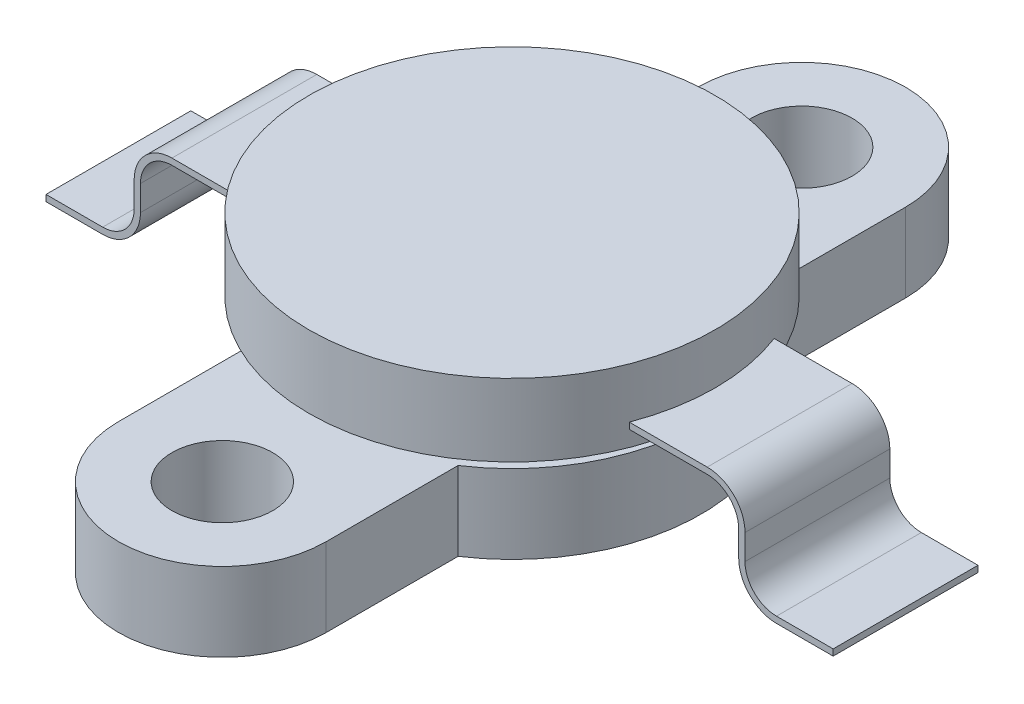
ISO-10303-21;
HEADER;
FILE_DESCRIPTION(('STEP AP214'),'2;1');
FILE_NAME('part.step','',(''),(''),'','','');
FILE_SCHEMA(('AUTOMOTIVE_DESIGN { 1 0 10303 214 1 1 1 1 }'));
ENDSEC;
DATA;
#1=APPLICATION_CONTEXT('core data for automotive mechanical design processes');
#2=APPLICATION_PROTOCOL_DEFINITION('international standard','automotive_design',2000,#1);
#3=PRODUCT_CONTEXT('',#1,'mechanical');
#4=PRODUCT('Part','Part','',(#3));
#5=PRODUCT_RELATED_PRODUCT_CATEGORY('part','',(#4));
#6=PRODUCT_DEFINITION_FORMATION('','',#4);
#7=PRODUCT_DEFINITION_CONTEXT('part definition',#1,'design');
#8=PRODUCT_DEFINITION('design','',#6,#7);
#9=PRODUCT_DEFINITION_SHAPE('','',#8);
#10=(LENGTH_UNIT() NAMED_UNIT(*) SI_UNIT(.MILLI.,.METRE.));
#11=(NAMED_UNIT(*) PLANE_ANGLE_UNIT() SI_UNIT($,.RADIAN.));
#12=(NAMED_UNIT(*) SI_UNIT($,.STERADIAN.) SOLID_ANGLE_UNIT());
#13=UNCERTAINTY_MEASURE_WITH_UNIT(LENGTH_MEASURE(1.E-05),#10,'distance_accuracy_value','');
#14=(GEOMETRIC_REPRESENTATION_CONTEXT(3) GLOBAL_UNCERTAINTY_ASSIGNED_CONTEXT((#13)) GLOBAL_UNIT_ASSIGNED_CONTEXT((#10,
#11,#12)) REPRESENTATION_CONTEXT('',''));
#15=CARTESIAN_POINT('',(0.,0.,0.));
#16=DIRECTION('',(0.,0.,1.));
#17=DIRECTION('',(1.,0.,0.));
#18=AXIS2_PLACEMENT_3D('',#15,#16,#17);
#19=CARTESIAN_POINT('',(0.,2.5,-9.2));
#20=DIRECTION('',(0.,1.,0.));
#21=DIRECTION('',(0.,0.,1.));
#22=AXIS2_PLACEMENT_3D('',#19,#20,#21);
#23=PLANE('',#22);
#24=CARTESIAN_POINT('',(0.,2.5,9.2));
#25=DIRECTION('',(0.,1.,0.));
#26=DIRECTION('',(0.,0.,1.));
#27=AXIS2_PLACEMENT_3D('',#24,#25,#26);
#28=CIRCLE('',#27,1.6);
#29=CARTESIAN_POINT('',(0.,2.5,10.8));
#30=VERTEX_POINT('',#29);
#31=EDGE_CURVE('E440',#30,#30,#28,.T.);
#32=ORIENTED_EDGE('',*,*,#31,.F.);
#33=EDGE_LOOP('',(#32));
#34=FACE_BOUND('',#33,.T.);
#35=CARTESIAN_POINT('',(0.,2.5,-9.2));
#36=DIRECTION('',(0.,1.,0.));
#37=DIRECTION('',(0.,0.,1.));
#38=AXIS2_PLACEMENT_3D('',#35,#36,#37);
#39=CIRCLE('',#38,3.3);
#40=CARTESIAN_POINT('',(3.3,2.5,-9.2));
#41=VERTEX_POINT('',#40);
#42=CARTESIAN_POINT('',(-3.3,2.5,-9.2));
#43=VERTEX_POINT('',#42);
#44=EDGE_CURVE('E466',#41,#43,#39,.T.);
#45=ORIENTED_EDGE('',*,*,#44,.T.);
#46=DIRECTION('',(0.,0.,1.));
#47=VECTOR('',#46,1.);
#48=CARTESIAN_POINT('',(-3.3,2.5,-9.2));
#49=LINE('',#48,#47);
#50=CARTESIAN_POINT('',(-3.3,2.5,-5.01098792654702));
#51=VERTEX_POINT('',#50);
#52=EDGE_CURVE('E469',#43,#51,#49,.T.);
#53=ORIENTED_EDGE('',*,*,#52,.T.);
#54=CARTESIAN_POINT('',(0.,2.5,0.));
#55=DIRECTION('',(0.,1.,0.));
#56=DIRECTION('',(0.,0.,1.));
#57=AXIS2_PLACEMENT_3D('',#54,#55,#56);
#58=CIRCLE('',#57,6.);
#59=CARTESIAN_POINT('',(-3.3,2.5,5.01098792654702));
#60=VERTEX_POINT('',#59);
#61=EDGE_CURVE('E471',#51,#60,#58,.T.);
#62=ORIENTED_EDGE('',*,*,#61,.T.);
#63=DIRECTION('',(0.,0.,1.));
#64=VECTOR('',#63,1.);
#65=CARTESIAN_POINT('',(-3.3,2.5,9.2));
#66=LINE('',#65,#64);
#67=CARTESIAN_POINT('',(-3.3,2.5,9.2));
#68=VERTEX_POINT('',#67);
#69=EDGE_CURVE('E473',#60,#68,#66,.T.);
#70=ORIENTED_EDGE('',*,*,#69,.T.);
#71=CARTESIAN_POINT('',(0.,2.5,9.2));
#72=DIRECTION('',(0.,1.,0.));
#73=DIRECTION('',(0.,0.,-1.));
#74=AXIS2_PLACEMENT_3D('',#71,#72,#73);
#75=CIRCLE('',#74,3.3);
#76=CARTESIAN_POINT('',(3.3,2.5,9.2));
#77=VERTEX_POINT('',#76);
#78=EDGE_CURVE('E475',#68,#77,#75,.T.);
#79=ORIENTED_EDGE('',*,*,#78,.T.);
#80=DIRECTION('',(0.,0.,-1.));
#81=VECTOR('',#80,1.);
#82=CARTESIAN_POINT('',(3.3,2.5,9.2));
#83=LINE('',#82,#81);
#84=CARTESIAN_POINT('',(3.3,2.5,5.01098792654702));
#85=VERTEX_POINT('',#84);
#86=EDGE_CURVE('E477',#77,#85,#83,.T.);
#87=ORIENTED_EDGE('',*,*,#86,.T.);
#88=CARTESIAN_POINT('',(0.,2.5,0.));
#89=DIRECTION('',(0.,1.,0.));
#90=DIRECTION('',(0.,0.,1.));
#91=AXIS2_PLACEMENT_3D('',#88,#89,#90);
#92=CIRCLE('',#91,6.);
#93=CARTESIAN_POINT('',(3.3,2.5,-5.01098792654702));
#94=VERTEX_POINT('',#93);
#95=EDGE_CURVE('E479',#85,#94,#92,.T.);
#96=ORIENTED_EDGE('',*,*,#95,.T.);
#97=DIRECTION('',(0.,0.,-1.));
#98=VECTOR('',#97,1.);
#99=CARTESIAN_POINT('',(3.3,2.5,-9.2));
#100=LINE('',#99,#98);
#101=EDGE_CURVE('E481',#94,#41,#100,.T.);
#102=ORIENTED_EDGE('',*,*,#101,.T.);
#103=EDGE_LOOP('',(#45,#53,#62,#70,#79,#87,#96,#102));
#104=FACE_BOUND('',#103,.T.);
#105=CARTESIAN_POINT('',(0.,2.5,-9.2));
#106=DIRECTION('',(0.,1.,0.));
#107=DIRECTION('',(0.,0.,1.));
#108=AXIS2_PLACEMENT_3D('',#105,#106,#107);
#109=CIRCLE('',#108,1.6);
#110=CARTESIAN_POINT('',(0.,2.5,-7.6));
#111=VERTEX_POINT('',#110);
#112=EDGE_CURVE('E446',#111,#111,#109,.T.);
#113=ORIENTED_EDGE('',*,*,#112,.F.);
#114=EDGE_LOOP('',(#113));
#115=FACE_BOUND('',#114,.T.);
#116=CARTESIAN_POINT('',(0.,2.5,0.));
#117=DIRECTION('',(0.,1.,0.));
#118=DIRECTION('',(0.,0.,1.));
#119=AXIS2_PLACEMENT_3D('',#116,#117,#118);
#120=CIRCLE('',#119,3.75);
#121=CARTESIAN_POINT('',(0.,2.5,3.75));
#122=VERTEX_POINT('',#121);
#123=EDGE_CURVE('E431',#122,#122,#120,.T.);
#124=ORIENTED_EDGE('',*,*,#123,.F.);
#125=EDGE_LOOP('',(#124));
#126=FACE_BOUND('',#125,.T.);
#127=ADVANCED_FACE('F32',(#34,#104,#115,#126),#23,.T.);
#128=CARTESIAN_POINT('',(0.,0.,-9.2));
#129=DIRECTION('',(0.,1.,0.));
#130=DIRECTION('',(0.,0.,1.));
#131=AXIS2_PLACEMENT_3D('',#128,#129,#130);
#132=PLANE('',#131);
#133=CARTESIAN_POINT('',(0.,0.,-9.2));
#134=DIRECTION('',(0.,1.,0.));
#135=DIRECTION('',(0.,0.,1.));
#136=AXIS2_PLACEMENT_3D('',#133,#134,#135);
#137=CIRCLE('',#136,1.6);
#138=CARTESIAN_POINT('',(0.,0.,-7.6));
#139=VERTEX_POINT('',#138);
#140=EDGE_CURVE('E443',#139,#139,#137,.T.);
#141=ORIENTED_EDGE('',*,*,#140,.T.);
#142=EDGE_LOOP('',(#141));
#143=FACE_BOUND('',#142,.T.);
#144=CARTESIAN_POINT('',(0.,0.,-9.2));
#145=DIRECTION('',(0.,1.,0.));
#146=DIRECTION('',(0.,0.,1.));
#147=AXIS2_PLACEMENT_3D('',#144,#145,#146);
#148=CIRCLE('',#147,3.3);
#149=CARTESIAN_POINT('',(3.3,0.,-9.2));
#150=VERTEX_POINT('',#149);
#151=CARTESIAN_POINT('',(-3.3,0.,-9.2));
#152=VERTEX_POINT('',#151);
#153=EDGE_CURVE('E449',#150,#152,#148,.T.);
#154=ORIENTED_EDGE('',*,*,#153,.F.);
#155=DIRECTION('',(0.,0.,-1.));
#156=VECTOR('',#155,1.);
#157=CARTESIAN_POINT('',(3.3,0.,-9.2));
#158=LINE('',#157,#156);
#159=CARTESIAN_POINT('',(3.3,0.,-5.01098792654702));
#160=VERTEX_POINT('',#159);
#161=EDGE_CURVE('E464',#160,#150,#158,.T.);
#162=ORIENTED_EDGE('',*,*,#161,.F.);
#163=CARTESIAN_POINT('',(0.,0.,0.));
#164=DIRECTION('',(0.,1.,0.));
#165=DIRECTION('',(0.,0.,1.));
#166=AXIS2_PLACEMENT_3D('',#163,#164,#165);
#167=CIRCLE('',#166,6.);
#168=CARTESIAN_POINT('',(3.3,0.,5.01098792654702));
#169=VERTEX_POINT('',#168);
#170=EDGE_CURVE('E462',#169,#160,#167,.T.);
#171=ORIENTED_EDGE('',*,*,#170,.F.);
#172=DIRECTION('',(0.,0.,-1.));
#173=VECTOR('',#172,1.);
#174=CARTESIAN_POINT('',(3.3,0.,9.2));
#175=LINE('',#174,#173);
#176=CARTESIAN_POINT('',(3.3,0.,9.2));
#177=VERTEX_POINT('',#176);
#178=EDGE_CURVE('E460',#177,#169,#175,.T.);
#179=ORIENTED_EDGE('',*,*,#178,.F.);
#180=CARTESIAN_POINT('',(0.,0.,9.2));
#181=DIRECTION('',(0.,1.,0.));
#182=DIRECTION('',(0.,0.,-1.));
#183=AXIS2_PLACEMENT_3D('',#180,#181,#182);
#184=CIRCLE('',#183,3.3);
#185=CARTESIAN_POINT('',(-3.3,0.,9.2));
#186=VERTEX_POINT('',#185);
#187=EDGE_CURVE('E458',#186,#177,#184,.T.);
#188=ORIENTED_EDGE('',*,*,#187,.F.);
#189=DIRECTION('',(0.,0.,1.));
#190=VECTOR('',#189,1.);
#191=CARTESIAN_POINT('',(-3.3,0.,9.2));
#192=LINE('',#191,#190);
#193=CARTESIAN_POINT('',(-3.3,0.,5.01098792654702));
#194=VERTEX_POINT('',#193);
#195=EDGE_CURVE('E456',#194,#186,#192,.T.);
#196=ORIENTED_EDGE('',*,*,#195,.F.);
#197=CARTESIAN_POINT('',(0.,0.,0.));
#198=DIRECTION('',(0.,1.,0.));
#199=DIRECTION('',(0.,0.,1.));
#200=AXIS2_PLACEMENT_3D('',#197,#198,#199);
#201=CIRCLE('',#200,6.);
#202=CARTESIAN_POINT('',(-3.3,0.,-5.01098792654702));
#203=VERTEX_POINT('',#202);
#204=EDGE_CURVE('E454',#203,#194,#201,.T.);
#205=ORIENTED_EDGE('',*,*,#204,.F.);
#206=DIRECTION('',(0.,0.,1.));
#207=VECTOR('',#206,1.);
#208=CARTESIAN_POINT('',(-3.3,0.,-9.2));
#209=LINE('',#208,#207);
#210=EDGE_CURVE('E452',#152,#203,#209,.T.);
#211=ORIENTED_EDGE('',*,*,#210,.F.);
#212=EDGE_LOOP('',(#154,#162,#171,#179,#188,#196,#205,#211));
#213=FACE_BOUND('',#212,.T.);
#214=CARTESIAN_POINT('',(0.,0.,9.2));
#215=DIRECTION('',(0.,1.,0.));
#216=DIRECTION('',(0.,0.,1.));
#217=AXIS2_PLACEMENT_3D('',#214,#215,#216);
#218=CIRCLE('',#217,1.6);
#219=CARTESIAN_POINT('',(0.,0.,10.8));
#220=VERTEX_POINT('',#219);
#221=EDGE_CURVE('E437',#220,#220,#218,.T.);
#222=ORIENTED_EDGE('',*,*,#221,.T.);
#223=EDGE_LOOP('',(#222));
#224=FACE_BOUND('',#223,.T.);
#225=ADVANCED_FACE('F549',(#143,#213,#224),#132,.F.);
#226=CARTESIAN_POINT('',(0.,2.5,-9.2));
#227=DIRECTION('',(0.,-1.,0.));
#228=DIRECTION('',(0.,0.,-1.));
#229=AXIS2_PLACEMENT_3D('',#226,#227,#228);
#230=CYLINDRICAL_SURFACE('',#229,3.3);
#231=ORIENTED_EDGE('',*,*,#153,.T.);
#232=DIRECTION('',(0.,-1.,0.));
#233=VECTOR('',#232,1.);
#234=CARTESIAN_POINT('',(-3.3,2.5,-9.2));
#235=LINE('',#234,#233);
#236=EDGE_CURVE('E504',#43,#152,#235,.T.);
#237=ORIENTED_EDGE('',*,*,#236,.F.);
#238=ORIENTED_EDGE('',*,*,#44,.F.);
#239=DIRECTION('',(0.,-1.,0.));
#240=VECTOR('',#239,1.);
#241=CARTESIAN_POINT('',(3.3,2.5,-9.2));
#242=LINE('',#241,#240);
#243=EDGE_CURVE('E483',#41,#150,#242,.T.);
#244=ORIENTED_EDGE('',*,*,#243,.T.);
#245=EDGE_LOOP('',(#231,#237,#238,#244));
#246=FACE_BOUND('',#245,.T.);
#247=ADVANCED_FACE('F34',(#246),#230,.T.);
#248=CARTESIAN_POINT('',(-3.3,2.5,-9.2));
#249=DIRECTION('',(1.,0.,0.));
#250=DIRECTION('',(0.,0.,-1.));
#251=AXIS2_PLACEMENT_3D('',#248,#249,#250);
#252=PLANE('',#251);
#253=ORIENTED_EDGE('',*,*,#210,.T.);
#254=DIRECTION('',(0.,-1.,0.));
#255=VECTOR('',#254,1.);
#256=CARTESIAN_POINT('',(-3.3,2.5,-5.01098792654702));
#257=LINE('',#256,#255);
#258=EDGE_CURVE('E501',#51,#203,#257,.T.);
#259=ORIENTED_EDGE('',*,*,#258,.F.);
#260=ORIENTED_EDGE('',*,*,#52,.F.);
#261=ORIENTED_EDGE('',*,*,#236,.T.);
#262=EDGE_LOOP('',(#253,#259,#260,#261));
#263=FACE_BOUND('',#262,.T.);
#264=ADVANCED_FACE('F584',(#263),#252,.F.);
#265=CARTESIAN_POINT('',(0.,2.5,0.));
#266=DIRECTION('',(0.,-1.,0.));
#267=DIRECTION('',(0.,0.,-1.));
#268=AXIS2_PLACEMENT_3D('',#265,#266,#267);
#269=CYLINDRICAL_SURFACE('',#268,6.);
#270=ORIENTED_EDGE('',*,*,#204,.T.);
#271=DIRECTION('',(0.,-1.,0.));
#272=VECTOR('',#271,1.);
#273=CARTESIAN_POINT('',(-3.3,2.5,5.01098792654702));
#274=LINE('',#273,#272);
#275=EDGE_CURVE('E498',#60,#194,#274,.T.);
#276=ORIENTED_EDGE('',*,*,#275,.F.);
#277=ORIENTED_EDGE('',*,*,#61,.F.);
#278=ORIENTED_EDGE('',*,*,#258,.T.);
#279=EDGE_LOOP('',(#270,#276,#277,#278));
#280=FACE_BOUND('',#279,.T.);
#281=ADVANCED_FACE('F581',(#280),#269,.T.);
#282=CARTESIAN_POINT('',(-3.3,2.5,9.2));
#283=DIRECTION('',(1.,0.,0.));
#284=DIRECTION('',(0.,0.,-1.));
#285=AXIS2_PLACEMENT_3D('',#282,#283,#284);
#286=PLANE('',#285);
#287=ORIENTED_EDGE('',*,*,#195,.T.);
#288=DIRECTION('',(0.,-1.,0.));
#289=VECTOR('',#288,1.);
#290=CARTESIAN_POINT('',(-3.3,2.5,9.2));
#291=LINE('',#290,#289);
#292=EDGE_CURVE('E495',#68,#186,#291,.T.);
#293=ORIENTED_EDGE('',*,*,#292,.F.);
#294=ORIENTED_EDGE('',*,*,#69,.F.);
#295=ORIENTED_EDGE('',*,*,#275,.T.);
#296=EDGE_LOOP('',(#287,#293,#294,#295));
#297=FACE_BOUND('',#296,.T.);
#298=ADVANCED_FACE('F577',(#297),#286,.F.);
#299=CARTESIAN_POINT('',(0.,2.5,9.2));
#300=DIRECTION('',(0.,-1.,0.));
#301=DIRECTION('',(0.,0.,-1.));
#302=AXIS2_PLACEMENT_3D('',#299,#300,#301);
#303=CYLINDRICAL_SURFACE('',#302,3.3);
#304=ORIENTED_EDGE('',*,*,#187,.T.);
#305=DIRECTION('',(0.,-1.,0.));
#306=VECTOR('',#305,1.);
#307=CARTESIAN_POINT('',(3.3,2.5,9.2));
#308=LINE('',#307,#306);
#309=EDGE_CURVE('E492',#77,#177,#308,.T.);
#310=ORIENTED_EDGE('',*,*,#309,.F.);
#311=ORIENTED_EDGE('',*,*,#78,.F.);
#312=ORIENTED_EDGE('',*,*,#292,.T.);
#313=EDGE_LOOP('',(#304,#310,#311,#312));
#314=FACE_BOUND('',#313,.T.);
#315=ADVANCED_FACE('F573',(#314),#303,.T.);
#316=CARTESIAN_POINT('',(3.3,2.5,9.2));
#317=DIRECTION('',(-1.,0.,0.));
#318=DIRECTION('',(0.,0.,1.));
#319=AXIS2_PLACEMENT_3D('',#316,#317,#318);
#320=PLANE('',#319);
#321=ORIENTED_EDGE('',*,*,#178,.T.);
#322=DIRECTION('',(0.,-1.,0.));
#323=VECTOR('',#322,1.);
#324=CARTESIAN_POINT('',(3.3,2.5,5.01098792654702));
#325=LINE('',#324,#323);
#326=EDGE_CURVE('E489',#85,#169,#325,.T.);
#327=ORIENTED_EDGE('',*,*,#326,.F.);
#328=ORIENTED_EDGE('',*,*,#86,.F.);
#329=ORIENTED_EDGE('',*,*,#309,.T.);
#330=EDGE_LOOP('',(#321,#327,#328,#329));
#331=FACE_BOUND('',#330,.T.);
#332=ADVANCED_FACE('F569',(#331),#320,.F.);
#333=CARTESIAN_POINT('',(0.,2.5,0.));
#334=DIRECTION('',(0.,-1.,0.));
#335=DIRECTION('',(0.,0.,-1.));
#336=AXIS2_PLACEMENT_3D('',#333,#334,#335);
#337=CYLINDRICAL_SURFACE('',#336,6.);
#338=ORIENTED_EDGE('',*,*,#170,.T.);
#339=DIRECTION('',(0.,-1.,0.));
#340=VECTOR('',#339,1.);
#341=CARTESIAN_POINT('',(3.3,2.5,-5.01098792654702));
#342=LINE('',#341,#340);
#343=EDGE_CURVE('E486',#94,#160,#342,.T.);
#344=ORIENTED_EDGE('',*,*,#343,.F.);
#345=ORIENTED_EDGE('',*,*,#95,.F.);
#346=ORIENTED_EDGE('',*,*,#326,.T.);
#347=EDGE_LOOP('',(#338,#344,#345,#346));
#348=FACE_BOUND('',#347,.T.);
#349=ADVANCED_FACE('F565',(#348),#337,.T.);
#350=CARTESIAN_POINT('',(3.3,2.5,-9.2));
#351=DIRECTION('',(-1.,0.,0.));
#352=DIRECTION('',(0.,0.,1.));
#353=AXIS2_PLACEMENT_3D('',#350,#351,#352);
#354=PLANE('',#353);
#355=ORIENTED_EDGE('',*,*,#161,.T.);
#356=ORIENTED_EDGE('',*,*,#243,.F.);
#357=ORIENTED_EDGE('',*,*,#101,.F.);
#358=ORIENTED_EDGE('',*,*,#343,.T.);
#359=EDGE_LOOP('',(#355,#356,#357,#358));
#360=FACE_BOUND('',#359,.T.);
#361=ADVANCED_FACE('F561',(#360),#354,.F.);
#362=CARTESIAN_POINT('',(0.,2.5,-9.2));
#363=DIRECTION('',(0.,-1.,0.));
#364=DIRECTION('',(0.,0.,-1.));
#365=AXIS2_PLACEMENT_3D('',#362,#363,#364);
#366=CYLINDRICAL_SURFACE('',#365,1.6);
#367=ORIENTED_EDGE('',*,*,#112,.T.);
#368=EDGE_LOOP('',(#367));
#369=FACE_BOUND('',#368,.T.);
#370=ORIENTED_EDGE('',*,*,#140,.F.);
#371=EDGE_LOOP('',(#370));
#372=FACE_BOUND('',#371,.T.);
#373=ADVANCED_FACE('F564',(#369,#372),#366,.F.);
#374=CARTESIAN_POINT('',(0.,2.5,9.2));
#375=DIRECTION('',(0.,-1.,0.));
#376=DIRECTION('',(0.,0.,-1.));
#377=AXIS2_PLACEMENT_3D('',#374,#375,#376);
#378=CYLINDRICAL_SURFACE('',#377,1.6);
#379=ORIENTED_EDGE('',*,*,#31,.T.);
#380=EDGE_LOOP('',(#379));
#381=FACE_BOUND('',#380,.T.);
#382=ORIENTED_EDGE('',*,*,#221,.F.);
#383=EDGE_LOOP('',(#382));
#384=FACE_BOUND('',#383,.T.);
#385=ADVANCED_FACE('F623',(#381,#384),#378,.F.);
#386=CARTESIAN_POINT('',(0.,3.,0.));
#387=DIRECTION('',(0.,-1.,0.));
#388=DIRECTION('',(0.,0.,-1.));
#389=AXIS2_PLACEMENT_3D('',#386,#387,#388);
#390=CYLINDRICAL_SURFACE('',#389,3.75);
#391=CARTESIAN_POINT('',(0.,3.,0.));
#392=DIRECTION('',(0.,1.,0.));
#393=DIRECTION('',(0.,0.,1.));
#394=AXIS2_PLACEMENT_3D('',#391,#392,#393);
#395=CIRCLE('',#394,3.75);
#396=CARTESIAN_POINT('',(0.,3.,3.75));
#397=VERTEX_POINT('',#396);
#398=EDGE_CURVE('E434',#397,#397,#395,.T.);
#399=ORIENTED_EDGE('',*,*,#398,.F.);
#400=EDGE_LOOP('',(#399));
#401=FACE_BOUND('',#400,.T.);
#402=ORIENTED_EDGE('',*,*,#123,.T.);
#403=EDGE_LOOP('',(#402));
#404=FACE_BOUND('',#403,.T.);
#405=ADVANCED_FACE('F621',(#401,#404),#390,.T.);
#406=CARTESIAN_POINT('',(0.,3.,0.));
#407=DIRECTION('',(0.,1.,0.));
#408=DIRECTION('',(0.,0.,1.));
#409=AXIS2_PLACEMENT_3D('',#406,#407,#408);
#410=PLANE('',#409);
#411=CARTESIAN_POINT('',(0.,3.,0.));
#412=DIRECTION('',(0.,1.,0.));
#413=DIRECTION('',(0.,0.,1.));
#414=AXIS2_PLACEMENT_3D('',#411,#412,#413);
#415=CIRCLE('',#414,6.45);
#416=CARTESIAN_POINT('',(0.,3.,6.45));
#417=VERTEX_POINT('',#416);
#418=EDGE_CURVE('E425',#417,#417,#415,.T.);
#419=ORIENTED_EDGE('',*,*,#418,.F.);
#420=EDGE_LOOP('',(#419));
#421=FACE_BOUND('',#420,.T.);
#422=ORIENTED_EDGE('',*,*,#398,.T.);
#423=EDGE_LOOP('',(#422));
#424=FACE_BOUND('',#423,.T.);
#425=ADVANCED_FACE('F530',(#421,#424),#410,.F.);
#426=CARTESIAN_POINT('',(0.,28.8433549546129,0.));
#427=DIRECTION('',(0.,-1.,0.));
#428=DIRECTION('',(0.,0.,-1.));
#429=AXIS2_PLACEMENT_3D('',#426,#427,#428);
#430=CYLINDRICAL_SURFACE('',#429,6.45);
#431=CARTESIAN_POINT('',(0.,3.5,0.));
#432=DIRECTION('',(0.,1.,0.));
#433=DIRECTION('',(-1.,0.,0.));
#434=AXIS2_PLACEMENT_3D('',#431,#432,#433);
#435=CIRCLE('',#434,6.45);
#436=CARTESIAN_POINT('',(6.02598539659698,3.5,2.3));
#437=VERTEX_POINT('',#436);
#438=CARTESIAN_POINT('',(6.02598539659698,3.5,-2.3));
#439=VERTEX_POINT('',#438);
#440=EDGE_CURVE('E513',#437,#439,#435,.T.);
#441=ORIENTED_EDGE('',*,*,#440,.F.);
#442=DIRECTION('',(0.,-1.,0.));
#443=VECTOR('',#442,1.);
#444=CARTESIAN_POINT('',(6.02598539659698,28.8433549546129,2.3));
#445=LINE('',#444,#443);
#446=CARTESIAN_POINT('',(6.02598539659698,3.7,2.3));
#447=VERTEX_POINT('',#446);
#448=EDGE_CURVE('E12',#437,#447,#445,.F.);
#449=ORIENTED_EDGE('',*,*,#448,.T.);
#450=CARTESIAN_POINT('',(0.,3.7,0.));
#451=DIRECTION('',(0.,-1.,0.));
#452=DIRECTION('',(1.,0.,0.));
#453=AXIS2_PLACEMENT_3D('',#450,#451,#452);
#454=CIRCLE('',#453,6.45);
#455=CARTESIAN_POINT('',(6.02598539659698,3.7,-2.3));
#456=VERTEX_POINT('',#455);
#457=EDGE_CURVE('E40',#456,#447,#454,.T.);
#458=ORIENTED_EDGE('',*,*,#457,.F.);
#459=DIRECTION('',(0.,-1.,0.));
#460=VECTOR('',#459,1.);
#461=CARTESIAN_POINT('',(6.02598539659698,28.8433549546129,-2.3));
#462=LINE('',#461,#460);
#463=EDGE_CURVE('E517',#456,#439,#462,.T.);
#464=ORIENTED_EDGE('',*,*,#463,.T.);
#465=EDGE_LOOP('',(#441,#449,#458,#464));
#466=FACE_BOUND('',#465,.T.);
#467=CARTESIAN_POINT('',(-6.02598539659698,3.7,2.3));
#468=VERTEX_POINT('',#467);
#469=CARTESIAN_POINT('',(-6.02598539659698,3.7,-2.3));
#470=VERTEX_POINT('',#469);
#471=EDGE_CURVE('E512',#468,#470,#454,.T.);
#472=ORIENTED_EDGE('',*,*,#471,.F.);
#473=DIRECTION('',(0.,-1.,0.));
#474=VECTOR('',#473,1.);
#475=CARTESIAN_POINT('',(-6.02598539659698,28.8433549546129,2.3));
#476=LINE('',#475,#474);
#477=CARTESIAN_POINT('',(-6.02598539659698,3.5,2.3));
#478=VERTEX_POINT('',#477);
#479=EDGE_CURVE('E515',#468,#478,#476,.T.);
#480=ORIENTED_EDGE('',*,*,#479,.T.);
#481=CARTESIAN_POINT('',(-6.02598539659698,3.5,-2.3));
#482=VERTEX_POINT('',#481);
#483=EDGE_CURVE('E510',#482,#478,#435,.T.);
#484=ORIENTED_EDGE('',*,*,#483,.F.);
#485=DIRECTION('',(0.,-1.,0.));
#486=VECTOR('',#485,1.);
#487=CARTESIAN_POINT('',(-6.02598539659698,28.8433549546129,-2.3));
#488=LINE('',#487,#486);
#489=EDGE_CURVE('E507',#482,#470,#488,.F.);
#490=ORIENTED_EDGE('',*,*,#489,.T.);
#491=EDGE_LOOP('',(#472,#480,#484,#490));
#492=FACE_BOUND('',#491,.T.);
#493=ORIENTED_EDGE('',*,*,#418,.T.);
#494=EDGE_LOOP('',(#493));
#495=FACE_BOUND('',#494,.T.);
#496=CARTESIAN_POINT('',(0.,5.3,0.));
#497=DIRECTION('',(0.,1.,0.));
#498=DIRECTION('',(0.,0.,1.));
#499=AXIS2_PLACEMENT_3D('',#496,#497,#498);
#500=CIRCLE('',#499,6.45);
#501=CARTESIAN_POINT('',(0.,5.3,6.45));
#502=VERTEX_POINT('',#501);
#503=EDGE_CURVE('E428',#502,#502,#500,.T.);
#504=ORIENTED_EDGE('',*,*,#503,.F.);
#505=EDGE_LOOP('',(#504));
#506=FACE_BOUND('',#505,.T.);
#507=ADVANCED_FACE('F526',(#466,#492,#495,#506),#430,.T.);
#508=CARTESIAN_POINT('',(0.,5.3,-9.2));
#509=DIRECTION('',(0.,1.,0.));
#510=DIRECTION('',(0.,0.,1.));
#511=AXIS2_PLACEMENT_3D('',#508,#509,#510);
#512=PLANE('',#511);
#513=ORIENTED_EDGE('',*,*,#503,.T.);
#514=EDGE_LOOP('',(#513));
#515=FACE_BOUND('',#514,.T.);
#516=ADVANCED_FACE('F529',(#515),#512,.T.);
#517=CARTESIAN_POINT('',(-8.5,2.5,0.));
#518=DIRECTION('',(0.,0.,1.));
#519=DIRECTION('',(1.,0.,0.));
#520=AXIS2_PLACEMENT_3D('',#517,#518,#519);
#521=CYLINDRICAL_SURFACE('',#520,1.2);
#522=DIRECTION('',(0.,0.,1.));
#523=VECTOR('',#522,1.);
#524=CARTESIAN_POINT('',(-8.5,3.7,2.3));
#525=LINE('',#524,#523);
#526=CARTESIAN_POINT('',(-8.5,3.7,-2.3));
#527=VERTEX_POINT('',#526);
#528=CARTESIAN_POINT('',(-8.5,3.7,2.3));
#529=VERTEX_POINT('',#528);
#530=EDGE_CURVE('E335',#527,#529,#525,.T.);
#531=ORIENTED_EDGE('',*,*,#530,.F.);
#532=CARTESIAN_POINT('',(-8.5,2.5,-2.3));
#533=DIRECTION('',(0.,0.,1.));
#534=DIRECTION('',(1.,0.,0.));
#535=AXIS2_PLACEMENT_3D('',#532,#533,#534);
#536=CIRCLE('',#535,1.2);
#537=CARTESIAN_POINT('',(-9.7,2.5,-2.3));
#538=VERTEX_POINT('',#537);
#539=EDGE_CURVE('E363',#527,#538,#536,.T.);
#540=ORIENTED_EDGE('',*,*,#539,.T.);
#541=DIRECTION('',(0.,0.,1.));
#542=VECTOR('',#541,1.);
#543=CARTESIAN_POINT('',(-9.7,2.5,2.3));
#544=LINE('',#543,#542);
#545=CARTESIAN_POINT('',(-9.7,2.5,2.3));
#546=VERTEX_POINT('',#545);
#547=EDGE_CURVE('E354',#538,#546,#544,.T.);
#548=ORIENTED_EDGE('',*,*,#547,.T.);
#549=CARTESIAN_POINT('',(-8.5,2.5,2.3));
#550=DIRECTION('',(0.,0.,1.));
#551=DIRECTION('',(1.,0.,0.));
#552=AXIS2_PLACEMENT_3D('',#549,#550,#551);
#553=CIRCLE('',#552,1.2);
#554=EDGE_CURVE('E366',#529,#546,#553,.T.);
#555=ORIENTED_EDGE('',*,*,#554,.F.);
#556=EDGE_LOOP('',(#531,#540,#548,#555));
#557=FACE_BOUND('',#556,.T.);
#558=ADVANCED_FACE('F539',(#557),#521,.T.);
#559=CARTESIAN_POINT('',(-9.7,2.5,2.3));
#560=DIRECTION('',(1.,0.,0.));
#561=DIRECTION('',(0.,1.,0.));
#562=AXIS2_PLACEMENT_3D('',#559,#560,#561);
#563=PLANE('',#562);
#564=ORIENTED_EDGE('',*,*,#547,.F.);
#565=DIRECTION('',(0.,-1.,0.));
#566=VECTOR('',#565,1.);
#567=CARTESIAN_POINT('',(-9.7,2.5,-2.3));
#568=LINE('',#567,#566);
#569=CARTESIAN_POINT('',(-9.7,1.69999999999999,-2.3));
#570=VERTEX_POINT('',#569);
#571=EDGE_CURVE('E381',#538,#570,#568,.T.);
#572=ORIENTED_EDGE('',*,*,#571,.T.);
#573=DIRECTION('',(0.,0.,1.));
#574=VECTOR('',#573,1.);
#575=CARTESIAN_POINT('',(-9.7,1.69999999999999,2.3));
#576=LINE('',#575,#574);
#577=CARTESIAN_POINT('',(-9.7,1.69999999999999,2.3));
#578=VERTEX_POINT('',#577);
#579=EDGE_CURVE('E372',#570,#578,#576,.T.);
#580=ORIENTED_EDGE('',*,*,#579,.T.);
#581=DIRECTION('',(0.,-1.,0.));
#582=VECTOR('',#581,1.);
#583=CARTESIAN_POINT('',(-9.7,2.5,2.3));
#584=LINE('',#583,#582);
#585=EDGE_CURVE('E384',#546,#578,#584,.T.);
#586=ORIENTED_EDGE('',*,*,#585,.F.);
#587=EDGE_LOOP('',(#564,#572,#580,#586));
#588=FACE_BOUND('',#587,.T.);
#589=ADVANCED_FACE('F544',(#588),#563,.F.);
#590=CARTESIAN_POINT('',(-10.7,1.7,0.));
#591=DIRECTION('',(0.,0.,-1.));
#592=DIRECTION('',(-1.,0.,0.));
#593=AXIS2_PLACEMENT_3D('',#590,#591,#592);
#594=CYLINDRICAL_SURFACE('',#593,1.);
#595=ORIENTED_EDGE('',*,*,#579,.F.);
#596=CARTESIAN_POINT('',(-10.7,1.7,-2.3));
#597=DIRECTION('',(0.,0.,-1.));
#598=DIRECTION('',(-1.,0.,0.));
#599=AXIS2_PLACEMENT_3D('',#596,#597,#598);
#600=CIRCLE('',#599,1.);
#601=CARTESIAN_POINT('',(-10.7,0.699999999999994,-2.3));
#602=VERTEX_POINT('',#601);
#603=EDGE_CURVE('E399',#570,#602,#600,.T.);
#604=ORIENTED_EDGE('',*,*,#603,.T.);
#605=DIRECTION('',(0.,0.,1.));
#606=VECTOR('',#605,1.);
#607=CARTESIAN_POINT('',(-10.7,0.699999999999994,2.3));
#608=LINE('',#607,#606);
#609=CARTESIAN_POINT('',(-10.7,0.699999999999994,2.3));
#610=VERTEX_POINT('',#609);
#611=EDGE_CURVE('E390',#602,#610,#608,.T.);
#612=ORIENTED_EDGE('',*,*,#611,.T.);
#613=CARTESIAN_POINT('',(-10.7,1.7,2.3));
#614=DIRECTION('',(0.,0.,-1.));
#615=DIRECTION('',(-1.,0.,0.));
#616=AXIS2_PLACEMENT_3D('',#613,#614,#615);
#617=CIRCLE('',#616,1.);
#618=EDGE_CURVE('E402',#578,#610,#617,.T.);
#619=ORIENTED_EDGE('',*,*,#618,.F.);
#620=EDGE_LOOP('',(#595,#604,#612,#619));
#621=FACE_BOUND('',#620,.T.);
#622=ADVANCED_FACE('F685',(#621),#594,.F.);
#623=CARTESIAN_POINT('',(-10.7,0.699999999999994,2.3));
#624=DIRECTION('',(0.,-1.,0.));
#625=DIRECTION('',(1.,0.,0.));
#626=AXIS2_PLACEMENT_3D('',#623,#624,#625);
#627=PLANE('',#626);
#628=ORIENTED_EDGE('',*,*,#611,.F.);
#629=DIRECTION('',(-1.,0.,0.));
#630=VECTOR('',#629,1.);
#631=CARTESIAN_POINT('',(-10.7,0.699999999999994,-2.3));
#632=LINE('',#631,#630);
#633=CARTESIAN_POINT('',(-12.5,0.699999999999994,-2.3));
#634=VERTEX_POINT('',#633);
#635=EDGE_CURVE('E419',#602,#634,#632,.T.);
#636=ORIENTED_EDGE('',*,*,#635,.T.);
#637=DIRECTION('',(0.,0.,1.));
#638=VECTOR('',#637,1.);
#639=CARTESIAN_POINT('',(-12.5,0.699999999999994,2.3));
#640=LINE('',#639,#638);
#641=CARTESIAN_POINT('',(-12.5,0.699999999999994,2.3));
#642=VERTEX_POINT('',#641);
#643=EDGE_CURVE('E411',#634,#642,#640,.T.);
#644=ORIENTED_EDGE('',*,*,#643,.T.);
#645=DIRECTION('',(-1.,0.,0.));
#646=VECTOR('',#645,1.);
#647=CARTESIAN_POINT('',(-10.7,0.699999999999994,2.3));
#648=LINE('',#647,#646);
#649=EDGE_CURVE('E422',#610,#642,#648,.T.);
#650=ORIENTED_EDGE('',*,*,#649,.F.);
#651=EDGE_LOOP('',(#628,#636,#644,#650));
#652=FACE_BOUND('',#651,.T.);
#653=ADVANCED_FACE('F695',(#652),#627,.F.);
#654=CARTESIAN_POINT('',(-12.5,0.699999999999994,2.3));
#655=DIRECTION('',(-1.,0.,0.));
#656=DIRECTION('',(0.,0.,1.));
#657=AXIS2_PLACEMENT_3D('',#654,#655,#656);
#658=PLANE('',#657);
#659=DIRECTION('',(0.,-1.,0.));
#660=VECTOR('',#659,1.);
#661=CARTESIAN_POINT('',(-12.5,0.499999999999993,2.3));
#662=LINE('',#661,#660);
#663=CARTESIAN_POINT('',(-12.5,0.499999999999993,2.3));
#664=VERTEX_POINT('',#663);
#665=EDGE_CURVE('E405',#642,#664,#662,.T.);
#666=ORIENTED_EDGE('',*,*,#665,.F.);
#667=ORIENTED_EDGE('',*,*,#643,.F.);
#668=DIRECTION('',(0.,1.,0.));
#669=VECTOR('',#668,1.);
#670=CARTESIAN_POINT('',(-12.5,0.499999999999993,-2.3));
#671=LINE('',#670,#669);
#672=CARTESIAN_POINT('',(-12.5,0.499999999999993,-2.3));
#673=VERTEX_POINT('',#672);
#674=EDGE_CURVE('E409',#673,#634,#671,.T.);
#675=ORIENTED_EDGE('',*,*,#674,.F.);
#676=DIRECTION('',(0.,0.,-1.));
#677=VECTOR('',#676,1.);
#678=CARTESIAN_POINT('',(-12.5,0.499999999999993,2.3));
#679=LINE('',#678,#677);
#680=EDGE_CURVE('E407',#664,#673,#679,.T.);
#681=ORIENTED_EDGE('',*,*,#680,.F.);
#682=EDGE_LOOP('',(#666,#667,#675,#681));
#683=FACE_BOUND('',#682,.T.);
#684=ADVANCED_FACE('F705',(#683),#658,.T.);
#685=CARTESIAN_POINT('',(-10.7,0.499999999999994,2.3));
#686=DIRECTION('',(0.,1.,0.));
#687=DIRECTION('',(-1.,0.,0.));
#688=AXIS2_PLACEMENT_3D('',#685,#686,#687);
#689=PLANE('',#688);
#690=DIRECTION('',(0.,0.,-1.));
#691=VECTOR('',#690,1.);
#692=CARTESIAN_POINT('',(-10.7,0.499999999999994,2.3));
#693=LINE('',#692,#691);
#694=CARTESIAN_POINT('',(-10.7,0.499999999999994,2.3));
#695=VERTEX_POINT('',#694);
#696=CARTESIAN_POINT('',(-10.7,0.499999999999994,-2.3));
#697=VERTEX_POINT('',#696);
#698=EDGE_CURVE('E387',#695,#697,#693,.T.);
#699=ORIENTED_EDGE('',*,*,#698,.F.);
#700=DIRECTION('',(-1.,0.,0.));
#701=VECTOR('',#700,1.);
#702=CARTESIAN_POINT('',(-10.7,0.499999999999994,2.3));
#703=LINE('',#702,#701);
#704=EDGE_CURVE('E413',#695,#664,#703,.T.);
#705=ORIENTED_EDGE('',*,*,#704,.T.);
#706=ORIENTED_EDGE('',*,*,#680,.T.);
#707=DIRECTION('',(-1.,0.,0.));
#708=VECTOR('',#707,1.);
#709=CARTESIAN_POINT('',(-10.7,0.499999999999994,-2.3));
#710=LINE('',#709,#708);
#711=EDGE_CURVE('E416',#697,#673,#710,.T.);
#712=ORIENTED_EDGE('',*,*,#711,.F.);
#713=EDGE_LOOP('',(#699,#705,#706,#712));
#714=FACE_BOUND('',#713,.T.);
#715=ADVANCED_FACE('F715',(#714),#689,.F.);
#716=CARTESIAN_POINT('',(-10.7,1.7,0.));
#717=DIRECTION('',(0.,0.,-1.));
#718=DIRECTION('',(-1.,0.,0.));
#719=AXIS2_PLACEMENT_3D('',#716,#717,#718);
#720=CYLINDRICAL_SURFACE('',#719,1.2);
#721=DIRECTION('',(0.,0.,-1.));
#722=VECTOR('',#721,1.);
#723=CARTESIAN_POINT('',(-9.5,1.69999999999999,2.3));
#724=LINE('',#723,#722);
#725=CARTESIAN_POINT('',(-9.5,1.69999999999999,2.3));
#726=VERTEX_POINT('',#725);
#727=CARTESIAN_POINT('',(-9.5,1.69999999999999,-2.3));
#728=VERTEX_POINT('',#727);
#729=EDGE_CURVE('E369',#726,#728,#724,.T.);
#730=ORIENTED_EDGE('',*,*,#729,.F.);
#731=CARTESIAN_POINT('',(-10.7,1.7,2.3));
#732=DIRECTION('',(0.,0.,-1.));
#733=DIRECTION('',(-1.,0.,0.));
#734=AXIS2_PLACEMENT_3D('',#731,#732,#733);
#735=CIRCLE('',#734,1.2);
#736=EDGE_CURVE('E393',#726,#695,#735,.T.);
#737=ORIENTED_EDGE('',*,*,#736,.T.);
#738=ORIENTED_EDGE('',*,*,#698,.T.);
#739=CARTESIAN_POINT('',(-10.7,1.7,-2.3));
#740=DIRECTION('',(0.,0.,-1.));
#741=DIRECTION('',(-1.,0.,0.));
#742=AXIS2_PLACEMENT_3D('',#739,#740,#741);
#743=CIRCLE('',#742,1.2);
#744=EDGE_CURVE('E396',#728,#697,#743,.T.);
#745=ORIENTED_EDGE('',*,*,#744,.F.);
#746=EDGE_LOOP('',(#730,#737,#738,#745));
#747=FACE_BOUND('',#746,.T.);
#748=ADVANCED_FACE('F725',(#747),#720,.T.);
#749=CARTESIAN_POINT('',(-9.49999999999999,2.5,2.3));
#750=DIRECTION('',(-1.,0.,0.));
#751=DIRECTION('',(0.,-1.,0.));
#752=AXIS2_PLACEMENT_3D('',#749,#750,#751);
#753=PLANE('',#752);
#754=DIRECTION('',(0.,0.,-1.));
#755=VECTOR('',#754,1.);
#756=CARTESIAN_POINT('',(-9.49999999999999,2.5,2.3));
#757=LINE('',#756,#755);
#758=CARTESIAN_POINT('',(-9.49999999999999,2.5,2.3));
#759=VERTEX_POINT('',#758);
#760=CARTESIAN_POINT('',(-9.49999999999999,2.5,-2.3));
#761=VERTEX_POINT('',#760);
#762=EDGE_CURVE('E351',#759,#761,#757,.T.);
#763=ORIENTED_EDGE('',*,*,#762,.F.);
#764=DIRECTION('',(0.,-1.,0.));
#765=VECTOR('',#764,1.);
#766=CARTESIAN_POINT('',(-9.49999999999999,2.5,2.3));
#767=LINE('',#766,#765);
#768=EDGE_CURVE('E375',#759,#726,#767,.T.);
#769=ORIENTED_EDGE('',*,*,#768,.T.);
#770=ORIENTED_EDGE('',*,*,#729,.T.);
#771=DIRECTION('',(0.,-1.,0.));
#772=VECTOR('',#771,1.);
#773=CARTESIAN_POINT('',(-9.49999999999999,2.5,-2.3));
#774=LINE('',#773,#772);
#775=EDGE_CURVE('E378',#761,#728,#774,.T.);
#776=ORIENTED_EDGE('',*,*,#775,.F.);
#777=EDGE_LOOP('',(#763,#769,#770,#776));
#778=FACE_BOUND('',#777,.T.);
#779=ADVANCED_FACE('F735',(#778),#753,.F.);
#780=CARTESIAN_POINT('',(-8.5,2.5,0.));
#781=DIRECTION('',(0.,0.,1.));
#782=DIRECTION('',(1.,0.,0.));
#783=AXIS2_PLACEMENT_3D('',#780,#781,#782);
#784=CYLINDRICAL_SURFACE('',#783,0.999999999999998);
#785=DIRECTION('',(0.,0.,-1.));
#786=VECTOR('',#785,1.);
#787=CARTESIAN_POINT('',(-8.5,3.5,2.3));
#788=LINE('',#787,#786);
#789=CARTESIAN_POINT('',(-8.5,3.5,2.3));
#790=VERTEX_POINT('',#789);
#791=CARTESIAN_POINT('',(-8.5,3.5,-2.3));
#792=VERTEX_POINT('',#791);
#793=EDGE_CURVE('E332',#790,#792,#788,.T.);
#794=ORIENTED_EDGE('',*,*,#793,.F.);
#795=CARTESIAN_POINT('',(-8.5,2.5,2.3));
#796=DIRECTION('',(0.,0.,1.));
#797=DIRECTION('',(1.,0.,0.));
#798=AXIS2_PLACEMENT_3D('',#795,#796,#797);
#799=CIRCLE('',#798,0.999999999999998);
#800=EDGE_CURVE('E357',#790,#759,#799,.T.);
#801=ORIENTED_EDGE('',*,*,#800,.T.);
#802=ORIENTED_EDGE('',*,*,#762,.T.);
#803=CARTESIAN_POINT('',(-8.5,2.5,-2.3));
#804=DIRECTION('',(0.,0.,1.));
#805=DIRECTION('',(1.,0.,0.));
#806=AXIS2_PLACEMENT_3D('',#803,#804,#805);
#807=CIRCLE('',#806,0.999999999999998);
#808=EDGE_CURVE('E360',#792,#761,#807,.T.);
#809=ORIENTED_EDGE('',*,*,#808,.F.);
#810=EDGE_LOOP('',(#794,#801,#802,#809));
#811=FACE_BOUND('',#810,.T.);
#812=ADVANCED_FACE('F745',(#811),#784,.F.);
#813=CARTESIAN_POINT('',(10.7,0.499999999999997,2.3));
#814=DIRECTION('',(0.,0.,1.));
#815=DIRECTION('',(1.,0.,0.));
#816=AXIS2_PLACEMENT_3D('',#813,#814,#815);
#817=PLANE('',#816);
#818=ORIENTED_EDGE('',*,*,#479,.F.);
#819=DIRECTION('',(-1.,0.,0.));
#820=VECTOR('',#819,1.);
#821=CARTESIAN_POINT('',(8.49999999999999,3.7,2.3));
#822=LINE('',#821,#820);
#823=EDGE_CURVE('E347',#468,#529,#822,.T.);
#824=ORIENTED_EDGE('',*,*,#823,.T.);
#825=ORIENTED_EDGE('',*,*,#554,.T.);
#826=ORIENTED_EDGE('',*,*,#585,.T.);
#827=ORIENTED_EDGE('',*,*,#618,.T.);
#828=ORIENTED_EDGE('',*,*,#649,.T.);
#829=ORIENTED_EDGE('',*,*,#665,.T.);
#830=ORIENTED_EDGE('',*,*,#704,.F.);
#831=ORIENTED_EDGE('',*,*,#736,.F.);
#832=ORIENTED_EDGE('',*,*,#768,.F.);
#833=ORIENTED_EDGE('',*,*,#800,.F.);
#834=DIRECTION('',(-1.,0.,0.));
#835=VECTOR('',#834,1.);
#836=CARTESIAN_POINT('',(8.49999999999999,3.5,2.3));
#837=LINE('',#836,#835);
#838=EDGE_CURVE('E338',#478,#790,#837,.T.);
#839=ORIENTED_EDGE('',*,*,#838,.F.);
#840=EDGE_LOOP('',(#818,#824,#825,#826,#827,#828,#829,#830,#831,#832,#833,#839));
#841=FACE_BOUND('',#840,.T.);
#842=ADVANCED_FACE('F755',(#841),#817,.T.);
#843=CARTESIAN_POINT('',(10.7,0.499999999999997,-2.3));
#844=DIRECTION('',(0.,0.,-1.));
#845=DIRECTION('',(-1.,0.,0.));
#846=AXIS2_PLACEMENT_3D('',#843,#844,#845);
#847=PLANE('',#846);
#848=ORIENTED_EDGE('',*,*,#489,.F.);
#849=DIRECTION('',(-1.,0.,0.));
#850=VECTOR('',#849,1.);
#851=CARTESIAN_POINT('',(8.49999999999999,3.5,-2.3));
#852=LINE('',#851,#850);
#853=EDGE_CURVE('E342',#482,#792,#852,.T.);
#854=ORIENTED_EDGE('',*,*,#853,.T.);
#855=ORIENTED_EDGE('',*,*,#808,.T.);
#856=ORIENTED_EDGE('',*,*,#775,.T.);
#857=ORIENTED_EDGE('',*,*,#744,.T.);
#858=ORIENTED_EDGE('',*,*,#711,.T.);
#859=ORIENTED_EDGE('',*,*,#674,.T.);
#860=ORIENTED_EDGE('',*,*,#635,.F.);
#861=ORIENTED_EDGE('',*,*,#603,.F.);
#862=ORIENTED_EDGE('',*,*,#571,.F.);
#863=ORIENTED_EDGE('',*,*,#539,.F.);
#864=DIRECTION('',(-1.,0.,0.));
#865=VECTOR('',#864,1.);
#866=CARTESIAN_POINT('',(8.49999999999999,3.7,-2.3));
#867=LINE('',#866,#865);
#868=EDGE_CURVE('E55',#470,#527,#867,.T.);
#869=ORIENTED_EDGE('',*,*,#868,.F.);
#870=EDGE_LOOP('',(#848,#854,#855,#856,#857,#858,#859,#860,#861,#862,#863,#869));
#871=FACE_BOUND('',#870,.T.);
#872=ADVANCED_FACE('F766',(#871),#847,.T.);
#873=CARTESIAN_POINT('',(8.49999999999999,3.5,2.3));
#874=DIRECTION('',(0.,1.,0.));
#875=DIRECTION('',(-1.,0.,0.));
#876=AXIS2_PLACEMENT_3D('',#873,#874,#875);
#877=PLANE('',#876);
#878=ORIENTED_EDGE('',*,*,#853,.F.);
#879=ORIENTED_EDGE('',*,*,#483,.T.);
#880=ORIENTED_EDGE('',*,*,#838,.T.);
#881=ORIENTED_EDGE('',*,*,#793,.T.);
#882=EDGE_LOOP('',(#878,#879,#880,#881));
#883=FACE_BOUND('',#882,.T.);
#884=ADVANCED_FACE('F778',(#883),#877,.F.);
#885=CARTESIAN_POINT('',(8.49999999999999,3.7,2.3));
#886=DIRECTION('',(0.,-1.,0.));
#887=DIRECTION('',(1.,0.,0.));
#888=AXIS2_PLACEMENT_3D('',#885,#886,#887);
#889=PLANE('',#888);
#890=ORIENTED_EDGE('',*,*,#823,.F.);
#891=ORIENTED_EDGE('',*,*,#471,.T.);
#892=ORIENTED_EDGE('',*,*,#868,.T.);
#893=ORIENTED_EDGE('',*,*,#530,.T.);
#894=EDGE_LOOP('',(#890,#891,#892,#893));
#895=FACE_BOUND('',#894,.T.);
#896=ADVANCED_FACE('F789',(#895),#889,.F.);
#897=CARTESIAN_POINT('',(8.49999999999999,3.7,-2.3));
#898=VERTEX_POINT('',#897);
#899=EDGE_CURVE('E344',#898,#456,#867,.T.);
#900=ORIENTED_EDGE('',*,*,#899,.T.);
#901=ORIENTED_EDGE('',*,*,#457,.T.);
#902=CARTESIAN_POINT('',(8.49999999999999,3.7,2.3));
#903=VERTEX_POINT('',#902);
#904=EDGE_CURVE('E348',#903,#447,#822,.T.);
#905=ORIENTED_EDGE('',*,*,#904,.F.);
#906=DIRECTION('',(0.,0.,1.));
#907=VECTOR('',#906,1.);
#908=CARTESIAN_POINT('',(8.49999999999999,3.7,2.3));
#909=LINE('',#908,#907);
#910=EDGE_CURVE('E318',#898,#903,#909,.T.);
#911=ORIENTED_EDGE('',*,*,#910,.F.);
#912=EDGE_LOOP('',(#900,#901,#905,#911));
#913=FACE_BOUND('',#912,.T.);
#914=ADVANCED_FACE('F524',(#913),#889,.F.);
#915=CARTESIAN_POINT('',(8.49999999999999,3.5,2.3));
#916=VERTEX_POINT('',#915);
#917=EDGE_CURVE('E339',#916,#437,#837,.T.);
#918=ORIENTED_EDGE('',*,*,#917,.T.);
#919=ORIENTED_EDGE('',*,*,#440,.T.);
#920=CARTESIAN_POINT('',(8.49999999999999,3.5,-2.3));
#921=VERTEX_POINT('',#920);
#922=EDGE_CURVE('E47',#921,#439,#852,.T.);
#923=ORIENTED_EDGE('',*,*,#922,.F.);
#924=DIRECTION('',(0.,0.,-1.));
#925=VECTOR('',#924,1.);
#926=CARTESIAN_POINT('',(8.49999999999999,3.5,2.3));
#927=LINE('',#926,#925);
#928=EDGE_CURVE('E315',#916,#921,#927,.T.);
#929=ORIENTED_EDGE('',*,*,#928,.F.);
#930=EDGE_LOOP('',(#918,#919,#923,#929));
#931=FACE_BOUND('',#930,.T.);
#932=ADVANCED_FACE('F792',(#931),#877,.F.);
#933=ORIENTED_EDGE('',*,*,#448,.F.);
#934=ORIENTED_EDGE('',*,*,#917,.F.);
#935=CARTESIAN_POINT('',(8.5,2.5,2.3));
#936=DIRECTION('',(0.,0.,1.));
#937=DIRECTION('',(1.,0.,0.));
#938=AXIS2_PLACEMENT_3D('',#935,#936,#937);
#939=CIRCLE('',#938,0.999999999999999);
#940=CARTESIAN_POINT('',(9.5,2.5,2.3));
#941=VERTEX_POINT('',#940);
#942=EDGE_CURVE('E321',#941,#916,#939,.T.);
#943=ORIENTED_EDGE('',*,*,#942,.F.);
#944=DIRECTION('',(0.,1.,0.));
#945=VECTOR('',#944,1.);
#946=CARTESIAN_POINT('',(9.5,1.7,2.3));
#947=LINE('',#946,#945);
#948=CARTESIAN_POINT('',(9.5,1.7,2.3));
#949=VERTEX_POINT('',#948);
#950=EDGE_CURVE('E303',#949,#941,#947,.T.);
#951=ORIENTED_EDGE('',*,*,#950,.F.);
#952=CARTESIAN_POINT('',(10.7,1.7,2.3));
#953=DIRECTION('',(0.,0.,-1.));
#954=DIRECTION('',(-1.,0.,0.));
#955=AXIS2_PLACEMENT_3D('',#952,#953,#954);
#956=CIRCLE('',#955,1.2);
#957=CARTESIAN_POINT('',(10.7,0.499999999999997,2.3));
#958=VERTEX_POINT('',#957);
#959=EDGE_CURVE('E249',#958,#949,#956,.T.);
#960=ORIENTED_EDGE('',*,*,#959,.F.);
#961=DIRECTION('',(1.,0.,0.));
#962=VECTOR('',#961,1.);
#963=CARTESIAN_POINT('',(10.7,0.499999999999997,2.3));
#964=LINE('',#963,#962);
#965=CARTESIAN_POINT('',(12.5,0.499999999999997,2.3));
#966=VERTEX_POINT('',#965);
#967=EDGE_CURVE('E241',#958,#966,#964,.T.);
#968=ORIENTED_EDGE('',*,*,#967,.T.);
#969=DIRECTION('',(0.,-1.,0.));
#970=VECTOR('',#969,1.);
#971=CARTESIAN_POINT('',(12.5,0.499999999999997,2.3));
#972=LINE('',#971,#970);
#973=CARTESIAN_POINT('',(12.5,0.699999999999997,2.3));
#974=VERTEX_POINT('',#973);
#975=EDGE_CURVE('E246',#974,#966,#972,.T.);
#976=ORIENTED_EDGE('',*,*,#975,.F.);
#977=DIRECTION('',(1.,0.,0.));
#978=VECTOR('',#977,1.);
#979=CARTESIAN_POINT('',(10.7,0.699999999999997,2.3));
#980=LINE('',#979,#978);
#981=CARTESIAN_POINT('',(10.7,0.699999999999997,2.3));
#982=VERTEX_POINT('',#981);
#983=EDGE_CURVE('E276',#982,#974,#980,.T.);
#984=ORIENTED_EDGE('',*,*,#983,.F.);
#985=CARTESIAN_POINT('',(10.7,1.7,2.3));
#986=DIRECTION('',(0.,0.,-1.));
#987=DIRECTION('',(-1.,0.,0.));
#988=AXIS2_PLACEMENT_3D('',#985,#986,#987);
#989=CIRCLE('',#988,1.);
#990=CARTESIAN_POINT('',(9.7,1.7,2.3));
#991=VERTEX_POINT('',#990);
#992=EDGE_CURVE('E294',#982,#991,#989,.T.);
#993=ORIENTED_EDGE('',*,*,#992,.T.);
#994=DIRECTION('',(0.,1.,0.));
#995=VECTOR('',#994,1.);
#996=CARTESIAN_POINT('',(9.7,1.7,2.3));
#997=LINE('',#996,#995);
#998=CARTESIAN_POINT('',(9.7,2.5,2.3));
#999=VERTEX_POINT('',#998);
#1000=EDGE_CURVE('E312',#991,#999,#997,.T.);
#1001=ORIENTED_EDGE('',*,*,#1000,.T.);
#1002=CARTESIAN_POINT('',(8.5,2.5,2.3));
#1003=DIRECTION('',(0.,0.,1.));
#1004=DIRECTION('',(1.,0.,0.));
#1005=AXIS2_PLACEMENT_3D('',#1002,#1003,#1004);
#1006=CIRCLE('',#1005,1.2);
#1007=EDGE_CURVE('E329',#999,#903,#1006,.T.);
#1008=ORIENTED_EDGE('',*,*,#1007,.T.);
#1009=ORIENTED_EDGE('',*,*,#904,.T.);
#1010=EDGE_LOOP('',(#933,#934,#943,#951,#960,#968,#976,#984,#993,#1001,#1008,#1009));
#1011=FACE_BOUND('',#1010,.T.);
#1012=ADVANCED_FACE('F243',(#1011),#817,.T.);
#1013=ORIENTED_EDGE('',*,*,#463,.F.);
#1014=ORIENTED_EDGE('',*,*,#899,.F.);
#1015=CARTESIAN_POINT('',(8.5,2.5,-2.3));
#1016=DIRECTION('',(0.,0.,1.));
#1017=DIRECTION('',(1.,0.,0.));
#1018=AXIS2_PLACEMENT_3D('',#1015,#1016,#1017);
#1019=CIRCLE('',#1018,1.2);
#1020=CARTESIAN_POINT('',(9.7,2.5,-2.3));
#1021=VERTEX_POINT('',#1020);
#1022=EDGE_CURVE('E326',#1021,#898,#1019,.T.);
#1023=ORIENTED_EDGE('',*,*,#1022,.F.);
#1024=DIRECTION('',(0.,1.,0.));
#1025=VECTOR('',#1024,1.);
#1026=CARTESIAN_POINT('',(9.7,1.7,-2.3));
#1027=LINE('',#1026,#1025);
#1028=CARTESIAN_POINT('',(9.7,1.7,-2.3));
#1029=VERTEX_POINT('',#1028);
#1030=EDGE_CURVE('E309',#1029,#1021,#1027,.T.);
#1031=ORIENTED_EDGE('',*,*,#1030,.F.);
#1032=CARTESIAN_POINT('',(10.7,1.7,-2.3));
#1033=DIRECTION('',(0.,0.,-1.));
#1034=DIRECTION('',(-1.,0.,0.));
#1035=AXIS2_PLACEMENT_3D('',#1032,#1033,#1034);
#1036=CIRCLE('',#1035,1.);
#1037=CARTESIAN_POINT('',(10.7,0.699999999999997,-2.3));
#1038=VERTEX_POINT('',#1037);
#1039=EDGE_CURVE('E291',#1038,#1029,#1036,.T.);
#1040=ORIENTED_EDGE('',*,*,#1039,.F.);
#1041=DIRECTION('',(1.,0.,0.));
#1042=VECTOR('',#1041,1.);
#1043=CARTESIAN_POINT('',(10.7,0.699999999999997,-2.3));
#1044=LINE('',#1043,#1042);
#1045=CARTESIAN_POINT('',(12.5,0.699999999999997,-2.3));
#1046=VERTEX_POINT('',#1045);
#1047=EDGE_CURVE('E279',#1038,#1046,#1044,.T.);
#1048=ORIENTED_EDGE('',*,*,#1047,.T.);
#1049=DIRECTION('',(0.,1.,0.));
#1050=VECTOR('',#1049,1.);
#1051=CARTESIAN_POINT('',(12.5,0.499999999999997,-2.3));
#1052=LINE('',#1051,#1050);
#1053=CARTESIAN_POINT('',(12.5,0.499999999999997,-2.3));
#1054=VERTEX_POINT('',#1053);
#1055=EDGE_CURVE('E263',#1054,#1046,#1052,.T.);
#1056=ORIENTED_EDGE('',*,*,#1055,.F.);
#1057=DIRECTION('',(1.,0.,0.));
#1058=VECTOR('',#1057,1.);
#1059=CARTESIAN_POINT('',(10.7,0.499999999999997,-2.3));
#1060=LINE('',#1059,#1058);
#1061=CARTESIAN_POINT('',(10.7,0.499999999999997,-2.3));
#1062=VERTEX_POINT('',#1061);
#1063=EDGE_CURVE('E253',#1062,#1054,#1060,.T.);
#1064=ORIENTED_EDGE('',*,*,#1063,.F.);
#1065=CARTESIAN_POINT('',(10.7,1.7,-2.3));
#1066=DIRECTION('',(0.,0.,-1.));
#1067=DIRECTION('',(-1.,0.,0.));
#1068=AXIS2_PLACEMENT_3D('',#1065,#1066,#1067);
#1069=CIRCLE('',#1068,1.2);
#1070=CARTESIAN_POINT('',(9.5,1.7,-2.3));
#1071=VERTEX_POINT('',#1070);
#1072=EDGE_CURVE('E288',#1062,#1071,#1069,.T.);
#1073=ORIENTED_EDGE('',*,*,#1072,.T.);
#1074=DIRECTION('',(0.,1.,0.));
#1075=VECTOR('',#1074,1.);
#1076=CARTESIAN_POINT('',(9.5,1.7,-2.3));
#1077=LINE('',#1076,#1075);
#1078=CARTESIAN_POINT('',(9.5,2.5,-2.3));
#1079=VERTEX_POINT('',#1078);
#1080=EDGE_CURVE('E306',#1071,#1079,#1077,.T.);
#1081=ORIENTED_EDGE('',*,*,#1080,.T.);
#1082=CARTESIAN_POINT('',(8.5,2.5,-2.3));
#1083=DIRECTION('',(0.,0.,1.));
#1084=DIRECTION('',(1.,0.,0.));
#1085=AXIS2_PLACEMENT_3D('',#1082,#1083,#1084);
#1086=CIRCLE('',#1085,0.999999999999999);
#1087=EDGE_CURVE('E324',#1079,#921,#1086,.T.);
#1088=ORIENTED_EDGE('',*,*,#1087,.T.);
#1089=ORIENTED_EDGE('',*,*,#922,.T.);
#1090=EDGE_LOOP('',(#1013,#1014,#1023,#1031,#1040,#1048,#1056,#1064,#1073,#1081,#1088,#1089));
#1091=FACE_BOUND('',#1090,.T.);
#1092=ADVANCED_FACE('F780',(#1091),#847,.T.);
#1093=CARTESIAN_POINT('',(8.5,2.5,0.));
#1094=DIRECTION('',(0.,0.,1.));
#1095=DIRECTION('',(1.,0.,0.));
#1096=AXIS2_PLACEMENT_3D('',#1093,#1094,#1095);
#1097=CYLINDRICAL_SURFACE('',#1096,1.2);
#1098=DIRECTION('',(0.,0.,1.));
#1099=VECTOR('',#1098,1.);
#1100=CARTESIAN_POINT('',(9.7,2.5,2.3));
#1101=LINE('',#1100,#1099);
#1102=EDGE_CURVE('E300',#1021,#999,#1101,.T.);
#1103=ORIENTED_EDGE('',*,*,#1102,.F.);
#1104=ORIENTED_EDGE('',*,*,#1022,.T.);
#1105=ORIENTED_EDGE('',*,*,#910,.T.);
#1106=ORIENTED_EDGE('',*,*,#1007,.F.);
#1107=EDGE_LOOP('',(#1103,#1104,#1105,#1106));
#1108=FACE_BOUND('',#1107,.T.);
#1109=ADVANCED_FACE('F833',(#1108),#1097,.T.);
#1110=CARTESIAN_POINT('',(8.5,2.5,0.));
#1111=DIRECTION('',(0.,0.,1.));
#1112=DIRECTION('',(1.,0.,0.));
#1113=AXIS2_PLACEMENT_3D('',#1110,#1111,#1112);
#1114=CYLINDRICAL_SURFACE('',#1113,0.999999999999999);
#1115=DIRECTION('',(0.,0.,-1.));
#1116=VECTOR('',#1115,1.);
#1117=CARTESIAN_POINT('',(9.5,2.5,2.3));
#1118=LINE('',#1117,#1116);
#1119=EDGE_CURVE('E297',#941,#1079,#1118,.T.);
#1120=ORIENTED_EDGE('',*,*,#1119,.F.);
#1121=ORIENTED_EDGE('',*,*,#942,.T.);
#1122=ORIENTED_EDGE('',*,*,#928,.T.);
#1123=ORIENTED_EDGE('',*,*,#1087,.F.);
#1124=EDGE_LOOP('',(#1120,#1121,#1122,#1123));
#1125=FACE_BOUND('',#1124,.T.);
#1126=ADVANCED_FACE('F842',(#1125),#1114,.F.);
#1127=CARTESIAN_POINT('',(9.7,1.7,2.3));
#1128=DIRECTION('',(-1.,0.,0.));
#1129=DIRECTION('',(0.,-1.,0.));
#1130=AXIS2_PLACEMENT_3D('',#1127,#1128,#1129);
#1131=PLANE('',#1130);
#1132=DIRECTION('',(0.,0.,1.));
#1133=VECTOR('',#1132,1.);
#1134=CARTESIAN_POINT('',(9.7,1.7,2.3));
#1135=LINE('',#1134,#1133);
#1136=EDGE_CURVE('E284',#1029,#991,#1135,.T.);
#1137=ORIENTED_EDGE('',*,*,#1136,.F.);
#1138=ORIENTED_EDGE('',*,*,#1030,.T.);
#1139=ORIENTED_EDGE('',*,*,#1102,.T.);
#1140=ORIENTED_EDGE('',*,*,#1000,.F.);
#1141=EDGE_LOOP('',(#1137,#1138,#1139,#1140));
#1142=FACE_BOUND('',#1141,.T.);
#1143=ADVANCED_FACE('F852',(#1142),#1131,.F.);
#1144=CARTESIAN_POINT('',(9.5,1.7,2.3));
#1145=DIRECTION('',(1.,0.,0.));
#1146=DIRECTION('',(0.,1.,0.));
#1147=AXIS2_PLACEMENT_3D('',#1144,#1145,#1146);
#1148=PLANE('',#1147);
#1149=DIRECTION('',(0.,0.,-1.));
#1150=VECTOR('',#1149,1.);
#1151=CARTESIAN_POINT('',(9.5,1.7,2.3));
#1152=LINE('',#1151,#1150);
#1153=EDGE_CURVE('E278',#949,#1071,#1152,.T.);
#1154=ORIENTED_EDGE('',*,*,#1153,.F.);
#1155=ORIENTED_EDGE('',*,*,#950,.T.);
#1156=ORIENTED_EDGE('',*,*,#1119,.T.);
#1157=ORIENTED_EDGE('',*,*,#1080,.F.);
#1158=EDGE_LOOP('',(#1154,#1155,#1156,#1157));
#1159=FACE_BOUND('',#1158,.T.);
#1160=ADVANCED_FACE('F862',(#1159),#1148,.F.);
#1161=CARTESIAN_POINT('',(10.7,1.7,0.));
#1162=DIRECTION('',(0.,0.,-1.));
#1163=DIRECTION('',(-1.,0.,0.));
#1164=AXIS2_PLACEMENT_3D('',#1161,#1162,#1163);
#1165=CYLINDRICAL_SURFACE('',#1164,1.);
#1166=DIRECTION('',(0.,0.,1.));
#1167=VECTOR('',#1166,1.);
#1168=CARTESIAN_POINT('',(10.7,0.699999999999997,2.3));
#1169=LINE('',#1168,#1167);
#1170=EDGE_CURVE('E254',#1038,#982,#1169,.T.);
#1171=ORIENTED_EDGE('',*,*,#1170,.F.);
#1172=ORIENTED_EDGE('',*,*,#1039,.T.);
#1173=ORIENTED_EDGE('',*,*,#1136,.T.);
#1174=ORIENTED_EDGE('',*,*,#992,.F.);
#1175=EDGE_LOOP('',(#1171,#1172,#1173,#1174));
#1176=FACE_BOUND('',#1175,.T.);
#1177=ADVANCED_FACE('F872',(#1176),#1165,.F.);
#1178=CARTESIAN_POINT('',(10.7,1.7,0.));
#1179=DIRECTION('',(0.,0.,-1.));
#1180=DIRECTION('',(-1.,0.,0.));
#1181=AXIS2_PLACEMENT_3D('',#1178,#1179,#1180);
#1182=CYLINDRICAL_SURFACE('',#1181,1.2);
#1183=DIRECTION('',(0.,0.,-1.));
#1184=VECTOR('',#1183,1.);
#1185=CARTESIAN_POINT('',(10.7,0.499999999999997,2.3));
#1186=LINE('',#1185,#1184);
#1187=EDGE_CURVE('E272',#958,#1062,#1186,.T.);
#1188=ORIENTED_EDGE('',*,*,#1187,.F.);
#1189=ORIENTED_EDGE('',*,*,#959,.T.);
#1190=ORIENTED_EDGE('',*,*,#1153,.T.);
#1191=ORIENTED_EDGE('',*,*,#1072,.F.);
#1192=EDGE_LOOP('',(#1188,#1189,#1190,#1191));
#1193=FACE_BOUND('',#1192,.T.);
#1194=ADVANCED_FACE('F882',(#1193),#1182,.T.);
#1195=CARTESIAN_POINT('',(10.7,0.699999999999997,2.3));
#1196=DIRECTION('',(0.,1.,0.));
#1197=DIRECTION('',(-1.,0.,0.));
#1198=AXIS2_PLACEMENT_3D('',#1195,#1196,#1197);
#1199=PLANE('',#1198);
#1200=DIRECTION('',(0.,0.,1.));
#1201=VECTOR('',#1200,1.);
#1202=CARTESIAN_POINT('',(12.5,0.699999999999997,2.3));
#1203=LINE('',#1202,#1201);
#1204=EDGE_CURVE('E267',#1046,#974,#1203,.T.);
#1205=ORIENTED_EDGE('',*,*,#1204,.F.);
#1206=ORIENTED_EDGE('',*,*,#1047,.F.);
#1207=ORIENTED_EDGE('',*,*,#1170,.T.);
#1208=ORIENTED_EDGE('',*,*,#983,.T.);
#1209=EDGE_LOOP('',(#1205,#1206,#1207,#1208));
#1210=FACE_BOUND('',#1209,.T.);
#1211=ADVANCED_FACE('F892',(#1210),#1199,.T.);
#1212=CARTESIAN_POINT('',(10.7,0.499999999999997,2.3));
#1213=DIRECTION('',(0.,-1.,0.));
#1214=DIRECTION('',(1.,0.,0.));
#1215=AXIS2_PLACEMENT_3D('',#1212,#1213,#1214);
#1216=PLANE('',#1215);
#1217=DIRECTION('',(0.,0.,-1.));
#1218=VECTOR('',#1217,1.);
#1219=CARTESIAN_POINT('',(12.5,0.499999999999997,2.3));
#1220=LINE('',#1219,#1218);
#1221=EDGE_CURVE('E257',#966,#1054,#1220,.T.);
#1222=ORIENTED_EDGE('',*,*,#1221,.F.);
#1223=ORIENTED_EDGE('',*,*,#967,.F.);
#1224=ORIENTED_EDGE('',*,*,#1187,.T.);
#1225=ORIENTED_EDGE('',*,*,#1063,.T.);
#1226=EDGE_LOOP('',(#1222,#1223,#1224,#1225));
#1227=FACE_BOUND('',#1226,.T.);
#1228=ADVANCED_FACE('F258',(#1227),#1216,.T.);
#1229=CARTESIAN_POINT('',(12.5,0.699999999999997,2.3));
#1230=DIRECTION('',(-1.,0.,0.));
#1231=DIRECTION('',(0.,0.,1.));
#1232=AXIS2_PLACEMENT_3D('',#1229,#1230,#1231);
#1233=PLANE('',#1232);
#1234=ORIENTED_EDGE('',*,*,#975,.T.);
#1235=ORIENTED_EDGE('',*,*,#1221,.T.);
#1236=ORIENTED_EDGE('',*,*,#1055,.T.);
#1237=ORIENTED_EDGE('',*,*,#1204,.T.);
#1238=EDGE_LOOP('',(#1234,#1235,#1236,#1237));
#1239=FACE_BOUND('',#1238,.T.);
#1240=ADVANCED_FACE('F265',(#1239),#1233,.F.);
#1241=CLOSED_SHELL('',(#127,#225,#247,#264,#281,#298,#315,#332,#349,#361,#373,#385,#405,#425,
#507,#516,#558,#589,#622,#653,#684,#715,#748,#779,#812,#842,#872,#884,#896,#914,#932,#1012,
#1092,#1109,#1126,#1143,#1160,#1177,#1194,#1211,#1228,#1240));
#1242=MANIFOLD_SOLID_BREP('B2',#1241);
#1243=ADVANCED_BREP_SHAPE_REPRESENTATION('',(#18,#1242),#14);
#1244=SHAPE_DEFINITION_REPRESENTATION(#9,#1243);
ENDSEC;
END-ISO-10303-21;
